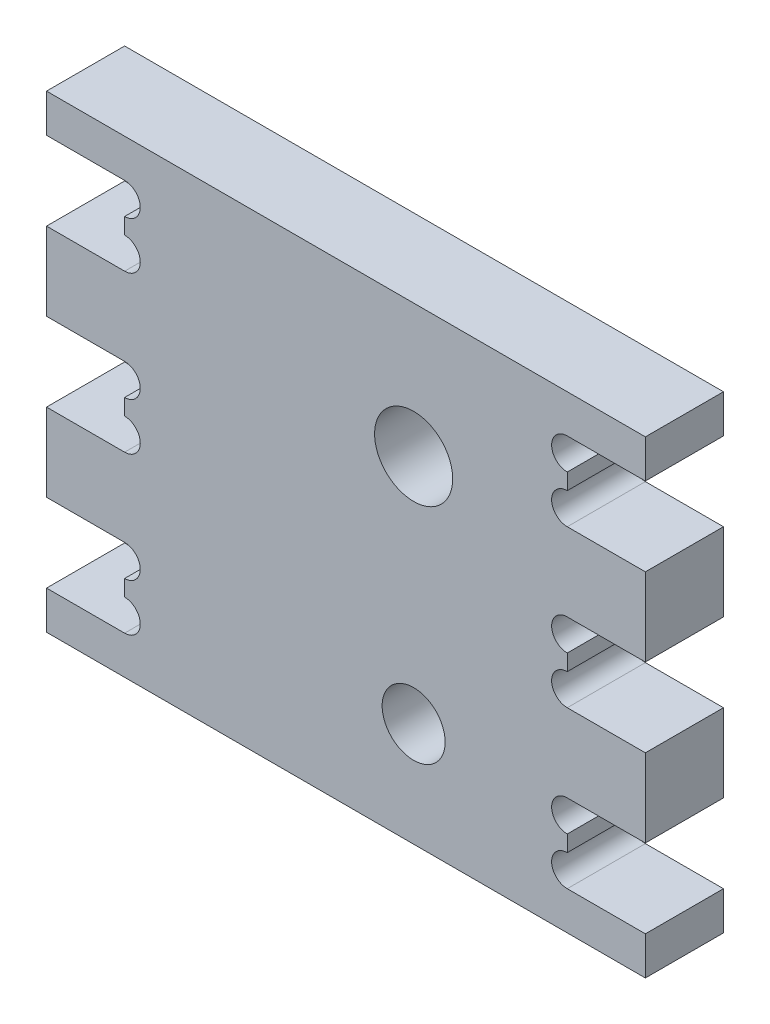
ISO-10303-21;
HEADER;
FILE_DESCRIPTION(('STEP AP214'),'2;1');
FILE_NAME('part.step','',(''),(''),'','','');
FILE_SCHEMA(('AUTOMOTIVE_DESIGN { 1 0 10303 214 1 1 1 1 }'));
ENDSEC;
DATA;
#1=APPLICATION_CONTEXT('core data for automotive mechanical design processes');
#2=APPLICATION_PROTOCOL_DEFINITION('international standard','automotive_design',2000,#1);
#3=PRODUCT_CONTEXT('',#1,'mechanical');
#4=PRODUCT('Part','Part','',(#3));
#5=PRODUCT_RELATED_PRODUCT_CATEGORY('part','',(#4));
#6=PRODUCT_DEFINITION_FORMATION('','',#4);
#7=PRODUCT_DEFINITION_CONTEXT('part definition',#1,'design');
#8=PRODUCT_DEFINITION('design','',#6,#7);
#9=PRODUCT_DEFINITION_SHAPE('','',#8);
#10=(LENGTH_UNIT() NAMED_UNIT(*) SI_UNIT(.MILLI.,.METRE.));
#11=(NAMED_UNIT(*) PLANE_ANGLE_UNIT() SI_UNIT($,.RADIAN.));
#12=(NAMED_UNIT(*) SI_UNIT($,.STERADIAN.) SOLID_ANGLE_UNIT());
#13=UNCERTAINTY_MEASURE_WITH_UNIT(LENGTH_MEASURE(1.E-05),#10,'distance_accuracy_value','');
#14=(GEOMETRIC_REPRESENTATION_CONTEXT(3) GLOBAL_UNCERTAINTY_ASSIGNED_CONTEXT((#13)) GLOBAL_UNIT_ASSIGNED_CONTEXT((#10,
#11,#12)) REPRESENTATION_CONTEXT('',''));
#15=CARTESIAN_POINT('',(0.,0.,0.));
#16=DIRECTION('',(0.,0.,1.));
#17=DIRECTION('',(1.,0.,0.));
#18=AXIS2_PLACEMENT_3D('',#15,#16,#17);
#19=CARTESIAN_POINT('',(0.,7.34999999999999,15.));
#20=DIRECTION('',(1.,0.,0.));
#21=DIRECTION('',(0.,1.,0.));
#22=AXIS2_PLACEMENT_3D('',#19,#20,#21);
#23=PLANE('',#22);
#24=DIRECTION('',(0.,-1.,0.));
#25=VECTOR('',#24,1.);
#26=CARTESIAN_POINT('',(0.,7.34999999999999,0.));
#27=LINE('',#26,#25);
#28=CARTESIAN_POINT('',(0.,7.34999999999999,0.));
#29=VERTEX_POINT('',#28);
#30=CARTESIAN_POINT('',(0.,0.,0.));
#31=VERTEX_POINT('',#30);
#32=EDGE_CURVE('E322',#29,#31,#27,.T.);
#33=ORIENTED_EDGE('',*,*,#32,.T.);
#34=DIRECTION('',(0.,0.,-1.));
#35=VECTOR('',#34,1.);
#36=CARTESIAN_POINT('',(0.,0.,15.));
#37=LINE('',#36,#35);
#38=CARTESIAN_POINT('',(0.,0.,15.));
#39=VERTEX_POINT('',#38);
#40=EDGE_CURVE('E11',#39,#31,#37,.T.);
#41=ORIENTED_EDGE('',*,*,#40,.F.);
#42=DIRECTION('',(0.,-1.,0.));
#43=VECTOR('',#42,1.);
#44=CARTESIAN_POINT('',(0.,7.34999999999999,15.));
#45=LINE('',#44,#43);
#46=CARTESIAN_POINT('',(0.,7.34999999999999,15.));
#47=VERTEX_POINT('',#46);
#48=EDGE_CURVE('E401',#47,#39,#45,.T.);
#49=ORIENTED_EDGE('',*,*,#48,.F.);
#50=DIRECTION('',(0.,0.,-1.));
#51=VECTOR('',#50,1.);
#52=CARTESIAN_POINT('',(0.,7.34999999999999,15.));
#53=LINE('',#52,#51);
#54=EDGE_CURVE('E318',#47,#29,#53,.T.);
#55=ORIENTED_EDGE('',*,*,#54,.T.);
#56=EDGE_LOOP('',(#33,#41,#49,#55));
#57=FACE_BOUND('',#56,.T.);
#58=ADVANCED_FACE('F34',(#57),#23,.F.);
#59=CARTESIAN_POINT('',(0.,0.,15.));
#60=DIRECTION('',(0.,1.,0.));
#61=DIRECTION('',(0.,0.,1.));
#62=AXIS2_PLACEMENT_3D('',#59,#60,#61);
#63=PLANE('',#62);
#64=DIRECTION('',(1.,0.,0.));
#65=VECTOR('',#64,1.);
#66=CARTESIAN_POINT('',(0.,0.,0.));
#67=LINE('',#66,#65);
#68=CARTESIAN_POINT('',(115.,0.,0.));
#69=VERTEX_POINT('',#68);
#70=EDGE_CURVE('E325',#31,#69,#67,.T.);
#71=ORIENTED_EDGE('',*,*,#70,.T.);
#72=DIRECTION('',(0.,0.,-1.));
#73=VECTOR('',#72,1.);
#74=CARTESIAN_POINT('',(115.,0.,15.));
#75=LINE('',#74,#73);
#76=CARTESIAN_POINT('',(115.,0.,15.));
#77=VERTEX_POINT('',#76);
#78=EDGE_CURVE('E42',#77,#69,#75,.T.);
#79=ORIENTED_EDGE('',*,*,#78,.F.);
#80=DIRECTION('',(1.,0.,0.));
#81=VECTOR('',#80,1.);
#82=CARTESIAN_POINT('',(0.,0.,15.));
#83=LINE('',#82,#81);
#84=EDGE_CURVE('E189',#39,#77,#83,.T.);
#85=ORIENTED_EDGE('',*,*,#84,.F.);
#86=ORIENTED_EDGE('',*,*,#40,.T.);
#87=EDGE_LOOP('',(#71,#79,#85,#86));
#88=FACE_BOUND('',#87,.T.);
#89=ADVANCED_FACE('F620',(#88),#63,.F.);
#90=CARTESIAN_POINT('',(115.,7.35,15.));
#91=DIRECTION('',(-1.,0.,0.));
#92=DIRECTION('',(0.,0.,1.));
#93=AXIS2_PLACEMENT_3D('',#90,#91,#92);
#94=PLANE('',#93);
#95=DIRECTION('',(0.,1.,0.));
#96=VECTOR('',#95,1.);
#97=CARTESIAN_POINT('',(115.,7.35,0.));
#98=LINE('',#97,#96);
#99=CARTESIAN_POINT('',(115.,7.35,0.));
#100=VERTEX_POINT('',#99);
#101=EDGE_CURVE('E328',#69,#100,#98,.T.);
#102=ORIENTED_EDGE('',*,*,#101,.T.);
#103=DIRECTION('',(0.,0.,-1.));
#104=VECTOR('',#103,1.);
#105=CARTESIAN_POINT('',(115.,7.35,15.));
#106=LINE('',#105,#104);
#107=CARTESIAN_POINT('',(115.,7.35,15.));
#108=VERTEX_POINT('',#107);
#109=EDGE_CURVE('E504',#108,#100,#106,.T.);
#110=ORIENTED_EDGE('',*,*,#109,.F.);
#111=DIRECTION('',(0.,1.,0.));
#112=VECTOR('',#111,1.);
#113=CARTESIAN_POINT('',(115.,7.35,15.));
#114=LINE('',#113,#112);
#115=EDGE_CURVE('E512',#77,#108,#114,.T.);
#116=ORIENTED_EDGE('',*,*,#115,.F.);
#117=ORIENTED_EDGE('',*,*,#78,.T.);
#118=EDGE_LOOP('',(#102,#110,#116,#117));
#119=FACE_BOUND('',#118,.T.);
#120=ADVANCED_FACE('F510',(#119),#94,.F.);
#121=CARTESIAN_POINT('',(100.,7.35,15.));
#122=DIRECTION('',(0.,-1.,0.));
#123=DIRECTION('',(0.,0.,-1.));
#124=AXIS2_PLACEMENT_3D('',#121,#122,#123);
#125=PLANE('',#124);
#126=DIRECTION('',(-1.,0.,0.));
#127=VECTOR('',#126,1.);
#128=CARTESIAN_POINT('',(100.,7.35,0.));
#129=LINE('',#128,#127);
#130=CARTESIAN_POINT('',(100.,7.35,0.));
#131=VERTEX_POINT('',#130);
#132=EDGE_CURVE('E330',#100,#131,#129,.T.);
#133=ORIENTED_EDGE('',*,*,#132,.T.);
#134=DIRECTION('',(0.,0.,-1.));
#135=VECTOR('',#134,1.);
#136=CARTESIAN_POINT('',(100.,7.35,15.));
#137=LINE('',#136,#135);
#138=CARTESIAN_POINT('',(100.,7.35,15.));
#139=VERTEX_POINT('',#138);
#140=EDGE_CURVE('E501',#139,#131,#137,.T.);
#141=ORIENTED_EDGE('',*,*,#140,.F.);
#142=DIRECTION('',(-1.,0.,0.));
#143=VECTOR('',#142,1.);
#144=CARTESIAN_POINT('',(100.,7.35,15.));
#145=LINE('',#144,#143);
#146=EDGE_CURVE('E530',#108,#139,#145,.T.);
#147=ORIENTED_EDGE('',*,*,#146,.F.);
#148=ORIENTED_EDGE('',*,*,#109,.T.);
#149=EDGE_LOOP('',(#133,#141,#147,#148));
#150=FACE_BOUND('',#149,.T.);
#151=ADVANCED_FACE('F521',(#150),#125,.F.);
#152=CARTESIAN_POINT('',(100.,10.35,15.));
#153=DIRECTION('',(0.,0.,-1.));
#154=DIRECTION('',(-1.,0.,0.));
#155=AXIS2_PLACEMENT_3D('',#152,#153,#154);
#156=CYLINDRICAL_SURFACE('',#155,3.);
#157=CARTESIAN_POINT('',(100.,10.35,0.));
#158=DIRECTION('',(0.,0.,-1.));
#159=DIRECTION('',(-1.,0.,0.));
#160=AXIS2_PLACEMENT_3D('',#157,#158,#159);
#161=CIRCLE('',#160,3.);
#162=CARTESIAN_POINT('',(100.,13.35,0.));
#163=VERTEX_POINT('',#162);
#164=EDGE_CURVE('E332',#131,#163,#161,.T.);
#165=ORIENTED_EDGE('',*,*,#164,.T.);
#166=DIRECTION('',(0.,0.,-1.));
#167=VECTOR('',#166,1.);
#168=CARTESIAN_POINT('',(100.,13.35,15.));
#169=LINE('',#168,#167);
#170=CARTESIAN_POINT('',(100.,13.35,15.));
#171=VERTEX_POINT('',#170);
#172=EDGE_CURVE('E498',#171,#163,#169,.T.);
#173=ORIENTED_EDGE('',*,*,#172,.F.);
#174=CARTESIAN_POINT('',(100.,10.35,15.));
#175=DIRECTION('',(0.,0.,-1.));
#176=DIRECTION('',(-1.,0.,0.));
#177=AXIS2_PLACEMENT_3D('',#174,#175,#176);
#178=CIRCLE('',#177,3.);
#179=EDGE_CURVE('E527',#139,#171,#178,.T.);
#180=ORIENTED_EDGE('',*,*,#179,.F.);
#181=ORIENTED_EDGE('',*,*,#140,.T.);
#182=EDGE_LOOP('',(#165,#173,#180,#181));
#183=FACE_BOUND('',#182,.T.);
#184=ADVANCED_FACE('F525',(#183),#156,.F.);
#185=CARTESIAN_POINT('',(100.,16.45,15.));
#186=DIRECTION('',(-1.,0.,0.));
#187=DIRECTION('',(0.,-1.,0.));
#188=AXIS2_PLACEMENT_3D('',#185,#186,#187);
#189=PLANE('',#188);
#190=DIRECTION('',(0.,1.,0.));
#191=VECTOR('',#190,1.);
#192=CARTESIAN_POINT('',(100.,16.45,0.));
#193=LINE('',#192,#191);
#194=CARTESIAN_POINT('',(100.,16.45,0.));
#195=VERTEX_POINT('',#194);
#196=EDGE_CURVE('E334',#163,#195,#193,.T.);
#197=ORIENTED_EDGE('',*,*,#196,.T.);
#198=DIRECTION('',(0.,0.,-1.));
#199=VECTOR('',#198,1.);
#200=CARTESIAN_POINT('',(100.,16.45,15.));
#201=LINE('',#200,#199);
#202=CARTESIAN_POINT('',(100.,16.45,15.));
#203=VERTEX_POINT('',#202);
#204=EDGE_CURVE('E495',#203,#195,#201,.T.);
#205=ORIENTED_EDGE('',*,*,#204,.F.);
#206=DIRECTION('',(0.,1.,0.));
#207=VECTOR('',#206,1.);
#208=CARTESIAN_POINT('',(100.,16.45,15.));
#209=LINE('',#208,#207);
#210=EDGE_CURVE('E529',#171,#203,#209,.T.);
#211=ORIENTED_EDGE('',*,*,#210,.F.);
#212=ORIENTED_EDGE('',*,*,#172,.T.);
#213=EDGE_LOOP('',(#197,#205,#211,#212));
#214=FACE_BOUND('',#213,.T.);
#215=ADVANCED_FACE('F633',(#214),#189,.F.);
#216=CARTESIAN_POINT('',(100.,19.45,15.));
#217=DIRECTION('',(0.,0.,-1.));
#218=DIRECTION('',(-1.,0.,0.));
#219=AXIS2_PLACEMENT_3D('',#216,#217,#218);
#220=CYLINDRICAL_SURFACE('',#219,3.);
#221=CARTESIAN_POINT('',(100.,19.45,0.));
#222=DIRECTION('',(0.,0.,-1.));
#223=DIRECTION('',(-1.,0.,0.));
#224=AXIS2_PLACEMENT_3D('',#221,#222,#223);
#225=CIRCLE('',#224,3.);
#226=CARTESIAN_POINT('',(100.,22.45,0.));
#227=VERTEX_POINT('',#226);
#228=EDGE_CURVE('E336',#195,#227,#225,.T.);
#229=ORIENTED_EDGE('',*,*,#228,.T.);
#230=DIRECTION('',(0.,0.,-1.));
#231=VECTOR('',#230,1.);
#232=CARTESIAN_POINT('',(100.,22.45,15.));
#233=LINE('',#232,#231);
#234=CARTESIAN_POINT('',(100.,22.45,15.));
#235=VERTEX_POINT('',#234);
#236=EDGE_CURVE('E492',#235,#227,#233,.T.);
#237=ORIENTED_EDGE('',*,*,#236,.F.);
#238=CARTESIAN_POINT('',(100.,19.45,15.));
#239=DIRECTION('',(0.,0.,-1.));
#240=DIRECTION('',(-1.,0.,0.));
#241=AXIS2_PLACEMENT_3D('',#238,#239,#240);
#242=CIRCLE('',#241,3.);
#243=EDGE_CURVE('E532',#203,#235,#242,.T.);
#244=ORIENTED_EDGE('',*,*,#243,.F.);
#245=ORIENTED_EDGE('',*,*,#204,.T.);
#246=EDGE_LOOP('',(#229,#237,#244,#245));
#247=FACE_BOUND('',#246,.T.);
#248=ADVANCED_FACE('F636',(#247),#220,.F.);
#249=CARTESIAN_POINT('',(115.,22.45,15.));
#250=DIRECTION('',(0.,1.,0.));
#251=DIRECTION('',(-1.,0.,0.));
#252=AXIS2_PLACEMENT_3D('',#249,#250,#251);
#253=PLANE('',#252);
#254=DIRECTION('',(1.,0.,0.));
#255=VECTOR('',#254,1.);
#256=CARTESIAN_POINT('',(115.,22.45,0.));
#257=LINE('',#256,#255);
#258=CARTESIAN_POINT('',(115.,22.45,0.));
#259=VERTEX_POINT('',#258);
#260=EDGE_CURVE('E338',#227,#259,#257,.T.);
#261=ORIENTED_EDGE('',*,*,#260,.T.);
#262=DIRECTION('',(0.,0.,-1.));
#263=VECTOR('',#262,1.);
#264=CARTESIAN_POINT('',(115.,22.45,15.));
#265=LINE('',#264,#263);
#266=CARTESIAN_POINT('',(115.,22.45,15.));
#267=VERTEX_POINT('',#266);
#268=EDGE_CURVE('E489',#267,#259,#265,.T.);
#269=ORIENTED_EDGE('',*,*,#268,.F.);
#270=DIRECTION('',(1.,0.,0.));
#271=VECTOR('',#270,1.);
#272=CARTESIAN_POINT('',(115.,22.45,15.));
#273=LINE('',#272,#271);
#274=EDGE_CURVE('E538',#235,#267,#273,.T.);
#275=ORIENTED_EDGE('',*,*,#274,.F.);
#276=ORIENTED_EDGE('',*,*,#236,.T.);
#277=EDGE_LOOP('',(#261,#269,#275,#276));
#278=FACE_BOUND('',#277,.T.);
#279=ADVANCED_FACE('F640',(#278),#253,.F.);
#280=CARTESIAN_POINT('',(115.,37.45,15.));
#281=DIRECTION('',(-1.,0.,0.));
#282=DIRECTION('',(0.,0.,1.));
#283=AXIS2_PLACEMENT_3D('',#280,#281,#282);
#284=PLANE('',#283);
#285=DIRECTION('',(0.,1.,0.));
#286=VECTOR('',#285,1.);
#287=CARTESIAN_POINT('',(115.,37.45,0.));
#288=LINE('',#287,#286);
#289=CARTESIAN_POINT('',(115.,37.45,0.));
#290=VERTEX_POINT('',#289);
#291=EDGE_CURVE('E340',#259,#290,#288,.T.);
#292=ORIENTED_EDGE('',*,*,#291,.T.);
#293=DIRECTION('',(0.,0.,-1.));
#294=VECTOR('',#293,1.);
#295=CARTESIAN_POINT('',(115.,37.45,15.));
#296=LINE('',#295,#294);
#297=CARTESIAN_POINT('',(115.,37.45,15.));
#298=VERTEX_POINT('',#297);
#299=EDGE_CURVE('E486',#298,#290,#296,.T.);
#300=ORIENTED_EDGE('',*,*,#299,.F.);
#301=DIRECTION('',(0.,1.,0.));
#302=VECTOR('',#301,1.);
#303=CARTESIAN_POINT('',(115.,37.45,15.));
#304=LINE('',#303,#302);
#305=EDGE_CURVE('E540',#267,#298,#304,.T.);
#306=ORIENTED_EDGE('',*,*,#305,.F.);
#307=ORIENTED_EDGE('',*,*,#268,.T.);
#308=EDGE_LOOP('',(#292,#300,#306,#307));
#309=FACE_BOUND('',#308,.T.);
#310=ADVANCED_FACE('F644',(#309),#284,.F.);
#311=CARTESIAN_POINT('',(100.,37.45,15.));
#312=DIRECTION('',(0.,-1.,0.));
#313=DIRECTION('',(0.,0.,-1.));
#314=AXIS2_PLACEMENT_3D('',#311,#312,#313);
#315=PLANE('',#314);
#316=DIRECTION('',(-1.,0.,0.));
#317=VECTOR('',#316,1.);
#318=CARTESIAN_POINT('',(100.,37.45,0.));
#319=LINE('',#318,#317);
#320=CARTESIAN_POINT('',(100.,37.45,0.));
#321=VERTEX_POINT('',#320);
#322=EDGE_CURVE('E342',#290,#321,#319,.T.);
#323=ORIENTED_EDGE('',*,*,#322,.T.);
#324=DIRECTION('',(0.,0.,-1.));
#325=VECTOR('',#324,1.);
#326=CARTESIAN_POINT('',(100.,37.45,15.));
#327=LINE('',#326,#325);
#328=CARTESIAN_POINT('',(100.,37.45,15.));
#329=VERTEX_POINT('',#328);
#330=EDGE_CURVE('E483',#329,#321,#327,.T.);
#331=ORIENTED_EDGE('',*,*,#330,.F.);
#332=DIRECTION('',(-1.,0.,0.));
#333=VECTOR('',#332,1.);
#334=CARTESIAN_POINT('',(100.,37.45,15.));
#335=LINE('',#334,#333);
#336=EDGE_CURVE('E542',#298,#329,#335,.T.);
#337=ORIENTED_EDGE('',*,*,#336,.F.);
#338=ORIENTED_EDGE('',*,*,#299,.T.);
#339=EDGE_LOOP('',(#323,#331,#337,#338));
#340=FACE_BOUND('',#339,.T.);
#341=ADVANCED_FACE('F648',(#340),#315,.F.);
#342=CARTESIAN_POINT('',(100.,40.45,15.));
#343=DIRECTION('',(0.,0.,-1.));
#344=DIRECTION('',(-1.,0.,0.));
#345=AXIS2_PLACEMENT_3D('',#342,#343,#344);
#346=CYLINDRICAL_SURFACE('',#345,3.);
#347=CARTESIAN_POINT('',(100.,40.45,0.));
#348=DIRECTION('',(0.,0.,-1.));
#349=DIRECTION('',(-1.,0.,0.));
#350=AXIS2_PLACEMENT_3D('',#347,#348,#349);
#351=CIRCLE('',#350,3.);
#352=CARTESIAN_POINT('',(100.,43.45,0.));
#353=VERTEX_POINT('',#352);
#354=EDGE_CURVE('E344',#321,#353,#351,.T.);
#355=ORIENTED_EDGE('',*,*,#354,.T.);
#356=DIRECTION('',(0.,0.,-1.));
#357=VECTOR('',#356,1.);
#358=CARTESIAN_POINT('',(100.,43.45,15.));
#359=LINE('',#358,#357);
#360=CARTESIAN_POINT('',(100.,43.45,15.));
#361=VERTEX_POINT('',#360);
#362=EDGE_CURVE('E480',#361,#353,#359,.T.);
#363=ORIENTED_EDGE('',*,*,#362,.F.);
#364=CARTESIAN_POINT('',(100.,40.45,15.));
#365=DIRECTION('',(0.,0.,-1.));
#366=DIRECTION('',(-1.,0.,0.));
#367=AXIS2_PLACEMENT_3D('',#364,#365,#366);
#368=CIRCLE('',#367,3.);
#369=EDGE_CURVE('E544',#329,#361,#368,.T.);
#370=ORIENTED_EDGE('',*,*,#369,.F.);
#371=ORIENTED_EDGE('',*,*,#330,.T.);
#372=EDGE_LOOP('',(#355,#363,#370,#371));
#373=FACE_BOUND('',#372,.T.);
#374=ADVANCED_FACE('F652',(#373),#346,.F.);
#375=CARTESIAN_POINT('',(100.,46.55,15.));
#376=DIRECTION('',(-1.,0.,0.));
#377=DIRECTION('',(0.,-1.,0.));
#378=AXIS2_PLACEMENT_3D('',#375,#376,#377);
#379=PLANE('',#378);
#380=DIRECTION('',(0.,1.,0.));
#381=VECTOR('',#380,1.);
#382=CARTESIAN_POINT('',(100.,46.55,0.));
#383=LINE('',#382,#381);
#384=CARTESIAN_POINT('',(100.,46.55,0.));
#385=VERTEX_POINT('',#384);
#386=EDGE_CURVE('E346',#353,#385,#383,.T.);
#387=ORIENTED_EDGE('',*,*,#386,.T.);
#388=DIRECTION('',(0.,0.,-1.));
#389=VECTOR('',#388,1.);
#390=CARTESIAN_POINT('',(100.,46.55,15.));
#391=LINE('',#390,#389);
#392=CARTESIAN_POINT('',(100.,46.55,15.));
#393=VERTEX_POINT('',#392);
#394=EDGE_CURVE('E477',#393,#385,#391,.T.);
#395=ORIENTED_EDGE('',*,*,#394,.F.);
#396=DIRECTION('',(0.,1.,0.));
#397=VECTOR('',#396,1.);
#398=CARTESIAN_POINT('',(100.,46.55,15.));
#399=LINE('',#398,#397);
#400=EDGE_CURVE('E546',#361,#393,#399,.T.);
#401=ORIENTED_EDGE('',*,*,#400,.F.);
#402=ORIENTED_EDGE('',*,*,#362,.T.);
#403=EDGE_LOOP('',(#387,#395,#401,#402));
#404=FACE_BOUND('',#403,.T.);
#405=ADVANCED_FACE('F656',(#404),#379,.F.);
#406=CARTESIAN_POINT('',(100.,49.55,15.));
#407=DIRECTION('',(0.,0.,-1.));
#408=DIRECTION('',(-1.,0.,0.));
#409=AXIS2_PLACEMENT_3D('',#406,#407,#408);
#410=CYLINDRICAL_SURFACE('',#409,3.);
#411=CARTESIAN_POINT('',(100.,49.55,0.));
#412=DIRECTION('',(0.,0.,-1.));
#413=DIRECTION('',(-1.,0.,0.));
#414=AXIS2_PLACEMENT_3D('',#411,#412,#413);
#415=CIRCLE('',#414,3.);
#416=CARTESIAN_POINT('',(100.,52.55,0.));
#417=VERTEX_POINT('',#416);
#418=EDGE_CURVE('E348',#385,#417,#415,.T.);
#419=ORIENTED_EDGE('',*,*,#418,.T.);
#420=DIRECTION('',(0.,0.,-1.));
#421=VECTOR('',#420,1.);
#422=CARTESIAN_POINT('',(100.,52.55,15.));
#423=LINE('',#422,#421);
#424=CARTESIAN_POINT('',(100.,52.55,15.));
#425=VERTEX_POINT('',#424);
#426=EDGE_CURVE('E474',#425,#417,#423,.T.);
#427=ORIENTED_EDGE('',*,*,#426,.F.);
#428=CARTESIAN_POINT('',(100.,49.55,15.));
#429=DIRECTION('',(0.,0.,-1.));
#430=DIRECTION('',(-1.,0.,0.));
#431=AXIS2_PLACEMENT_3D('',#428,#429,#430);
#432=CIRCLE('',#431,3.);
#433=EDGE_CURVE('E548',#393,#425,#432,.T.);
#434=ORIENTED_EDGE('',*,*,#433,.F.);
#435=ORIENTED_EDGE('',*,*,#394,.T.);
#436=EDGE_LOOP('',(#419,#427,#434,#435));
#437=FACE_BOUND('',#436,.T.);
#438=ADVANCED_FACE('F660',(#437),#410,.F.);
#439=CARTESIAN_POINT('',(115.,52.55,15.));
#440=DIRECTION('',(0.,1.,0.));
#441=DIRECTION('',(0.,0.,1.));
#442=AXIS2_PLACEMENT_3D('',#439,#440,#441);
#443=PLANE('',#442);
#444=DIRECTION('',(1.,0.,0.));
#445=VECTOR('',#444,1.);
#446=CARTESIAN_POINT('',(115.,52.55,0.));
#447=LINE('',#446,#445);
#448=CARTESIAN_POINT('',(115.,52.55,0.));
#449=VERTEX_POINT('',#448);
#450=EDGE_CURVE('E350',#417,#449,#447,.T.);
#451=ORIENTED_EDGE('',*,*,#450,.T.);
#452=DIRECTION('',(0.,0.,-1.));
#453=VECTOR('',#452,1.);
#454=CARTESIAN_POINT('',(115.,52.55,15.));
#455=LINE('',#454,#453);
#456=CARTESIAN_POINT('',(115.,52.55,15.));
#457=VERTEX_POINT('',#456);
#458=EDGE_CURVE('E471',#457,#449,#455,.T.);
#459=ORIENTED_EDGE('',*,*,#458,.F.);
#460=DIRECTION('',(1.,0.,0.));
#461=VECTOR('',#460,1.);
#462=CARTESIAN_POINT('',(115.,52.55,15.));
#463=LINE('',#462,#461);
#464=EDGE_CURVE('E550',#425,#457,#463,.T.);
#465=ORIENTED_EDGE('',*,*,#464,.F.);
#466=ORIENTED_EDGE('',*,*,#426,.T.);
#467=EDGE_LOOP('',(#451,#459,#465,#466));
#468=FACE_BOUND('',#467,.T.);
#469=ADVANCED_FACE('F664',(#468),#443,.F.);
#470=CARTESIAN_POINT('',(115.,67.55,15.));
#471=DIRECTION('',(-1.,0.,0.));
#472=DIRECTION('',(0.,0.,1.));
#473=AXIS2_PLACEMENT_3D('',#470,#471,#472);
#474=PLANE('',#473);
#475=DIRECTION('',(0.,1.,0.));
#476=VECTOR('',#475,1.);
#477=CARTESIAN_POINT('',(115.,67.55,0.));
#478=LINE('',#477,#476);
#479=CARTESIAN_POINT('',(115.,67.55,0.));
#480=VERTEX_POINT('',#479);
#481=EDGE_CURVE('E352',#449,#480,#478,.T.);
#482=ORIENTED_EDGE('',*,*,#481,.T.);
#483=DIRECTION('',(0.,0.,-1.));
#484=VECTOR('',#483,1.);
#485=CARTESIAN_POINT('',(115.,67.55,15.));
#486=LINE('',#485,#484);
#487=CARTESIAN_POINT('',(115.,67.55,15.));
#488=VERTEX_POINT('',#487);
#489=EDGE_CURVE('E468',#488,#480,#486,.T.);
#490=ORIENTED_EDGE('',*,*,#489,.F.);
#491=DIRECTION('',(0.,1.,0.));
#492=VECTOR('',#491,1.);
#493=CARTESIAN_POINT('',(115.,67.55,15.));
#494=LINE('',#493,#492);
#495=EDGE_CURVE('E552',#457,#488,#494,.T.);
#496=ORIENTED_EDGE('',*,*,#495,.F.);
#497=ORIENTED_EDGE('',*,*,#458,.T.);
#498=EDGE_LOOP('',(#482,#490,#496,#497));
#499=FACE_BOUND('',#498,.T.);
#500=ADVANCED_FACE('F668',(#499),#474,.F.);
#501=CARTESIAN_POINT('',(100.,67.55,15.));
#502=DIRECTION('',(0.,-1.,0.));
#503=DIRECTION('',(0.,0.,-1.));
#504=AXIS2_PLACEMENT_3D('',#501,#502,#503);
#505=PLANE('',#504);
#506=DIRECTION('',(-1.,0.,0.));
#507=VECTOR('',#506,1.);
#508=CARTESIAN_POINT('',(100.,67.55,0.));
#509=LINE('',#508,#507);
#510=CARTESIAN_POINT('',(100.,67.55,0.));
#511=VERTEX_POINT('',#510);
#512=EDGE_CURVE('E354',#480,#511,#509,.T.);
#513=ORIENTED_EDGE('',*,*,#512,.T.);
#514=DIRECTION('',(0.,0.,-1.));
#515=VECTOR('',#514,1.);
#516=CARTESIAN_POINT('',(100.,67.55,15.));
#517=LINE('',#516,#515);
#518=CARTESIAN_POINT('',(100.,67.55,15.));
#519=VERTEX_POINT('',#518);
#520=EDGE_CURVE('E465',#519,#511,#517,.T.);
#521=ORIENTED_EDGE('',*,*,#520,.F.);
#522=DIRECTION('',(-1.,0.,0.));
#523=VECTOR('',#522,1.);
#524=CARTESIAN_POINT('',(100.,67.55,15.));
#525=LINE('',#524,#523);
#526=EDGE_CURVE('E554',#488,#519,#525,.T.);
#527=ORIENTED_EDGE('',*,*,#526,.F.);
#528=ORIENTED_EDGE('',*,*,#489,.T.);
#529=EDGE_LOOP('',(#513,#521,#527,#528));
#530=FACE_BOUND('',#529,.T.);
#531=ADVANCED_FACE('F672',(#530),#505,.F.);
#532=CARTESIAN_POINT('',(100.,70.55,15.));
#533=DIRECTION('',(0.,0.,-1.));
#534=DIRECTION('',(-1.,0.,0.));
#535=AXIS2_PLACEMENT_3D('',#532,#533,#534);
#536=CYLINDRICAL_SURFACE('',#535,3.);
#537=CARTESIAN_POINT('',(100.,70.55,0.));
#538=DIRECTION('',(0.,0.,-1.));
#539=DIRECTION('',(-1.,0.,0.));
#540=AXIS2_PLACEMENT_3D('',#537,#538,#539);
#541=CIRCLE('',#540,3.);
#542=CARTESIAN_POINT('',(100.,73.55,0.));
#543=VERTEX_POINT('',#542);
#544=EDGE_CURVE('E356',#511,#543,#541,.T.);
#545=ORIENTED_EDGE('',*,*,#544,.T.);
#546=DIRECTION('',(0.,0.,-1.));
#547=VECTOR('',#546,1.);
#548=CARTESIAN_POINT('',(100.,73.55,15.));
#549=LINE('',#548,#547);
#550=CARTESIAN_POINT('',(100.,73.55,15.));
#551=VERTEX_POINT('',#550);
#552=EDGE_CURVE('E462',#551,#543,#549,.T.);
#553=ORIENTED_EDGE('',*,*,#552,.F.);
#554=CARTESIAN_POINT('',(100.,70.55,15.));
#555=DIRECTION('',(0.,0.,-1.));
#556=DIRECTION('',(-1.,0.,0.));
#557=AXIS2_PLACEMENT_3D('',#554,#555,#556);
#558=CIRCLE('',#557,3.);
#559=EDGE_CURVE('E556',#519,#551,#558,.T.);
#560=ORIENTED_EDGE('',*,*,#559,.F.);
#561=ORIENTED_EDGE('',*,*,#520,.T.);
#562=EDGE_LOOP('',(#545,#553,#560,#561));
#563=FACE_BOUND('',#562,.T.);
#564=ADVANCED_FACE('F676',(#563),#536,.F.);
#565=CARTESIAN_POINT('',(100.,76.65,15.));
#566=DIRECTION('',(-1.,0.,0.));
#567=DIRECTION('',(0.,0.,1.));
#568=AXIS2_PLACEMENT_3D('',#565,#566,#567);
#569=PLANE('',#568);
#570=DIRECTION('',(0.,1.,0.));
#571=VECTOR('',#570,1.);
#572=CARTESIAN_POINT('',(100.,76.65,0.));
#573=LINE('',#572,#571);
#574=CARTESIAN_POINT('',(100.,76.65,0.));
#575=VERTEX_POINT('',#574);
#576=EDGE_CURVE('E358',#543,#575,#573,.T.);
#577=ORIENTED_EDGE('',*,*,#576,.T.);
#578=DIRECTION('',(0.,0.,-1.));
#579=VECTOR('',#578,1.);
#580=CARTESIAN_POINT('',(100.,76.65,15.));
#581=LINE('',#580,#579);
#582=CARTESIAN_POINT('',(100.,76.65,15.));
#583=VERTEX_POINT('',#582);
#584=EDGE_CURVE('E459',#583,#575,#581,.T.);
#585=ORIENTED_EDGE('',*,*,#584,.F.);
#586=DIRECTION('',(0.,1.,0.));
#587=VECTOR('',#586,1.);
#588=CARTESIAN_POINT('',(100.,76.65,15.));
#589=LINE('',#588,#587);
#590=EDGE_CURVE('E558',#551,#583,#589,.T.);
#591=ORIENTED_EDGE('',*,*,#590,.F.);
#592=ORIENTED_EDGE('',*,*,#552,.T.);
#593=EDGE_LOOP('',(#577,#585,#591,#592));
#594=FACE_BOUND('',#593,.T.);
#595=ADVANCED_FACE('F680',(#594),#569,.F.);
#596=CARTESIAN_POINT('',(100.,79.65,15.));
#597=DIRECTION('',(0.,0.,-1.));
#598=DIRECTION('',(-1.,0.,0.));
#599=AXIS2_PLACEMENT_3D('',#596,#597,#598);
#600=CYLINDRICAL_SURFACE('',#599,3.);
#601=CARTESIAN_POINT('',(100.,79.65,0.));
#602=DIRECTION('',(0.,0.,-1.));
#603=DIRECTION('',(-1.,0.,0.));
#604=AXIS2_PLACEMENT_3D('',#601,#602,#603);
#605=CIRCLE('',#604,3.);
#606=CARTESIAN_POINT('',(100.,82.65,0.));
#607=VERTEX_POINT('',#606);
#608=EDGE_CURVE('E360',#575,#607,#605,.T.);
#609=ORIENTED_EDGE('',*,*,#608,.T.);
#610=DIRECTION('',(0.,0.,-1.));
#611=VECTOR('',#610,1.);
#612=CARTESIAN_POINT('',(100.,82.65,15.));
#613=LINE('',#612,#611);
#614=CARTESIAN_POINT('',(100.,82.65,15.));
#615=VERTEX_POINT('',#614);
#616=EDGE_CURVE('E456',#615,#607,#613,.T.);
#617=ORIENTED_EDGE('',*,*,#616,.F.);
#618=CARTESIAN_POINT('',(100.,79.65,15.));
#619=DIRECTION('',(0.,0.,-1.));
#620=DIRECTION('',(-1.,0.,0.));
#621=AXIS2_PLACEMENT_3D('',#618,#619,#620);
#622=CIRCLE('',#621,3.);
#623=EDGE_CURVE('E560',#583,#615,#622,.T.);
#624=ORIENTED_EDGE('',*,*,#623,.F.);
#625=ORIENTED_EDGE('',*,*,#584,.T.);
#626=EDGE_LOOP('',(#609,#617,#624,#625));
#627=FACE_BOUND('',#626,.T.);
#628=ADVANCED_FACE('F684',(#627),#600,.F.);
#629=CARTESIAN_POINT('',(115.,82.65,15.));
#630=DIRECTION('',(0.,1.,0.));
#631=DIRECTION('',(0.,0.,1.));
#632=AXIS2_PLACEMENT_3D('',#629,#630,#631);
#633=PLANE('',#632);
#634=DIRECTION('',(1.,0.,0.));
#635=VECTOR('',#634,1.);
#636=CARTESIAN_POINT('',(115.,82.65,0.));
#637=LINE('',#636,#635);
#638=CARTESIAN_POINT('',(115.,82.65,0.));
#639=VERTEX_POINT('',#638);
#640=EDGE_CURVE('E362',#607,#639,#637,.T.);
#641=ORIENTED_EDGE('',*,*,#640,.T.);
#642=DIRECTION('',(0.,0.,-1.));
#643=VECTOR('',#642,1.);
#644=CARTESIAN_POINT('',(115.,82.65,15.));
#645=LINE('',#644,#643);
#646=CARTESIAN_POINT('',(115.,82.65,15.));
#647=VERTEX_POINT('',#646);
#648=EDGE_CURVE('E453',#647,#639,#645,.T.);
#649=ORIENTED_EDGE('',*,*,#648,.F.);
#650=DIRECTION('',(1.,0.,0.));
#651=VECTOR('',#650,1.);
#652=CARTESIAN_POINT('',(115.,82.65,15.));
#653=LINE('',#652,#651);
#654=EDGE_CURVE('E562',#615,#647,#653,.T.);
#655=ORIENTED_EDGE('',*,*,#654,.F.);
#656=ORIENTED_EDGE('',*,*,#616,.T.);
#657=EDGE_LOOP('',(#641,#649,#655,#656));
#658=FACE_BOUND('',#657,.T.);
#659=ADVANCED_FACE('F688',(#658),#633,.F.);
#660=CARTESIAN_POINT('',(115.,90.,15.));
#661=DIRECTION('',(-1.,0.,0.));
#662=DIRECTION('',(0.,0.,1.));
#663=AXIS2_PLACEMENT_3D('',#660,#661,#662);
#664=PLANE('',#663);
#665=DIRECTION('',(0.,1.,0.));
#666=VECTOR('',#665,1.);
#667=CARTESIAN_POINT('',(115.,90.,0.));
#668=LINE('',#667,#666);
#669=CARTESIAN_POINT('',(115.,90.,0.));
#670=VERTEX_POINT('',#669);
#671=EDGE_CURVE('E364',#639,#670,#668,.T.);
#672=ORIENTED_EDGE('',*,*,#671,.T.);
#673=DIRECTION('',(0.,0.,-1.));
#674=VECTOR('',#673,1.);
#675=CARTESIAN_POINT('',(115.,90.,15.));
#676=LINE('',#675,#674);
#677=CARTESIAN_POINT('',(115.,90.,15.));
#678=VERTEX_POINT('',#677);
#679=EDGE_CURVE('E450',#678,#670,#676,.T.);
#680=ORIENTED_EDGE('',*,*,#679,.F.);
#681=DIRECTION('',(0.,1.,0.));
#682=VECTOR('',#681,1.);
#683=CARTESIAN_POINT('',(115.,90.,15.));
#684=LINE('',#683,#682);
#685=EDGE_CURVE('E564',#647,#678,#684,.T.);
#686=ORIENTED_EDGE('',*,*,#685,.F.);
#687=ORIENTED_EDGE('',*,*,#648,.T.);
#688=EDGE_LOOP('',(#672,#680,#686,#687));
#689=FACE_BOUND('',#688,.T.);
#690=ADVANCED_FACE('F692',(#689),#664,.F.);
#691=CARTESIAN_POINT('',(0.,90.,15.));
#692=DIRECTION('',(0.,-1.,0.));
#693=DIRECTION('',(0.,0.,-1.));
#694=AXIS2_PLACEMENT_3D('',#691,#692,#693);
#695=PLANE('',#694);
#696=DIRECTION('',(-1.,0.,0.));
#697=VECTOR('',#696,1.);
#698=CARTESIAN_POINT('',(0.,90.,0.));
#699=LINE('',#698,#697);
#700=CARTESIAN_POINT('',(0.,90.,0.));
#701=VERTEX_POINT('',#700);
#702=EDGE_CURVE('E366',#670,#701,#699,.T.);
#703=ORIENTED_EDGE('',*,*,#702,.T.);
#704=DIRECTION('',(0.,0.,-1.));
#705=VECTOR('',#704,1.);
#706=CARTESIAN_POINT('',(0.,90.,15.));
#707=LINE('',#706,#705);
#708=CARTESIAN_POINT('',(0.,90.,15.));
#709=VERTEX_POINT('',#708);
#710=EDGE_CURVE('E447',#709,#701,#707,.T.);
#711=ORIENTED_EDGE('',*,*,#710,.F.);
#712=DIRECTION('',(-1.,0.,0.));
#713=VECTOR('',#712,1.);
#714=CARTESIAN_POINT('',(0.,90.,15.));
#715=LINE('',#714,#713);
#716=EDGE_CURVE('E566',#678,#709,#715,.T.);
#717=ORIENTED_EDGE('',*,*,#716,.F.);
#718=ORIENTED_EDGE('',*,*,#679,.T.);
#719=EDGE_LOOP('',(#703,#711,#717,#718));
#720=FACE_BOUND('',#719,.T.);
#721=ADVANCED_FACE('F696',(#720),#695,.F.);
#722=CARTESIAN_POINT('',(0.,82.65,15.));
#723=DIRECTION('',(1.,0.,0.));
#724=DIRECTION('',(0.,1.,0.));
#725=AXIS2_PLACEMENT_3D('',#722,#723,#724);
#726=PLANE('',#725);
#727=DIRECTION('',(0.,-1.,0.));
#728=VECTOR('',#727,1.);
#729=CARTESIAN_POINT('',(0.,82.65,0.));
#730=LINE('',#729,#728);
#731=CARTESIAN_POINT('',(0.,82.65,0.));
#732=VERTEX_POINT('',#731);
#733=EDGE_CURVE('E368',#701,#732,#730,.T.);
#734=ORIENTED_EDGE('',*,*,#733,.T.);
#735=DIRECTION('',(0.,0.,-1.));
#736=VECTOR('',#735,1.);
#737=CARTESIAN_POINT('',(0.,82.65,15.));
#738=LINE('',#737,#736);
#739=CARTESIAN_POINT('',(0.,82.65,15.));
#740=VERTEX_POINT('',#739);
#741=EDGE_CURVE('E444',#740,#732,#738,.T.);
#742=ORIENTED_EDGE('',*,*,#741,.F.);
#743=DIRECTION('',(0.,-1.,0.));
#744=VECTOR('',#743,1.);
#745=CARTESIAN_POINT('',(0.,82.65,15.));
#746=LINE('',#745,#744);
#747=EDGE_CURVE('E568',#709,#740,#746,.T.);
#748=ORIENTED_EDGE('',*,*,#747,.F.);
#749=ORIENTED_EDGE('',*,*,#710,.T.);
#750=EDGE_LOOP('',(#734,#742,#748,#749));
#751=FACE_BOUND('',#750,.T.);
#752=ADVANCED_FACE('F700',(#751),#726,.F.);
#753=CARTESIAN_POINT('',(15.,82.65,15.));
#754=DIRECTION('',(0.,1.,0.));
#755=DIRECTION('',(-1.,0.,0.));
#756=AXIS2_PLACEMENT_3D('',#753,#754,#755);
#757=PLANE('',#756);
#758=DIRECTION('',(1.,0.,0.));
#759=VECTOR('',#758,1.);
#760=CARTESIAN_POINT('',(15.,82.65,0.));
#761=LINE('',#760,#759);
#762=CARTESIAN_POINT('',(15.,82.65,0.));
#763=VERTEX_POINT('',#762);
#764=EDGE_CURVE('E370',#732,#763,#761,.T.);
#765=ORIENTED_EDGE('',*,*,#764,.T.);
#766=DIRECTION('',(0.,0.,-1.));
#767=VECTOR('',#766,1.);
#768=CARTESIAN_POINT('',(15.,82.65,15.));
#769=LINE('',#768,#767);
#770=CARTESIAN_POINT('',(15.,82.65,15.));
#771=VERTEX_POINT('',#770);
#772=EDGE_CURVE('E441',#771,#763,#769,.T.);
#773=ORIENTED_EDGE('',*,*,#772,.F.);
#774=DIRECTION('',(1.,0.,0.));
#775=VECTOR('',#774,1.);
#776=CARTESIAN_POINT('',(15.,82.65,15.));
#777=LINE('',#776,#775);
#778=EDGE_CURVE('E570',#740,#771,#777,.T.);
#779=ORIENTED_EDGE('',*,*,#778,.F.);
#780=ORIENTED_EDGE('',*,*,#741,.T.);
#781=EDGE_LOOP('',(#765,#773,#779,#780));
#782=FACE_BOUND('',#781,.T.);
#783=ADVANCED_FACE('F704',(#782),#757,.F.);
#784=CARTESIAN_POINT('',(15.,79.65,15.));
#785=DIRECTION('',(0.,0.,-1.));
#786=DIRECTION('',(-1.,0.,0.));
#787=AXIS2_PLACEMENT_3D('',#784,#785,#786);
#788=CYLINDRICAL_SURFACE('',#787,3.);
#789=CARTESIAN_POINT('',(15.,79.65,0.));
#790=DIRECTION('',(0.,0.,-1.));
#791=DIRECTION('',(1.,0.,0.));
#792=AXIS2_PLACEMENT_3D('',#789,#790,#791);
#793=CIRCLE('',#792,3.);
#794=CARTESIAN_POINT('',(15.,76.65,0.));
#795=VERTEX_POINT('',#794);
#796=EDGE_CURVE('E372',#763,#795,#793,.T.);
#797=ORIENTED_EDGE('',*,*,#796,.T.);
#798=DIRECTION('',(0.,0.,-1.));
#799=VECTOR('',#798,1.);
#800=CARTESIAN_POINT('',(15.,76.65,15.));
#801=LINE('',#800,#799);
#802=CARTESIAN_POINT('',(15.,76.65,15.));
#803=VERTEX_POINT('',#802);
#804=EDGE_CURVE('E438',#803,#795,#801,.T.);
#805=ORIENTED_EDGE('',*,*,#804,.F.);
#806=CARTESIAN_POINT('',(15.,79.65,15.));
#807=DIRECTION('',(0.,0.,-1.));
#808=DIRECTION('',(1.,0.,0.));
#809=AXIS2_PLACEMENT_3D('',#806,#807,#808);
#810=CIRCLE('',#809,3.);
#811=EDGE_CURVE('E572',#771,#803,#810,.T.);
#812=ORIENTED_EDGE('',*,*,#811,.F.);
#813=ORIENTED_EDGE('',*,*,#772,.T.);
#814=EDGE_LOOP('',(#797,#805,#812,#813));
#815=FACE_BOUND('',#814,.T.);
#816=ADVANCED_FACE('F708',(#815),#788,.F.);
#817=CARTESIAN_POINT('',(15.,76.65,15.));
#818=DIRECTION('',(1.,0.,0.));
#819=DIRECTION('',(0.,1.,0.));
#820=AXIS2_PLACEMENT_3D('',#817,#818,#819);
#821=PLANE('',#820);
#822=DIRECTION('',(0.,-1.,0.));
#823=VECTOR('',#822,1.);
#824=CARTESIAN_POINT('',(15.,76.65,0.));
#825=LINE('',#824,#823);
#826=CARTESIAN_POINT('',(15.,73.55,0.));
#827=VERTEX_POINT('',#826);
#828=EDGE_CURVE('E374',#795,#827,#825,.T.);
#829=ORIENTED_EDGE('',*,*,#828,.T.);
#830=DIRECTION('',(0.,0.,-1.));
#831=VECTOR('',#830,1.);
#832=CARTESIAN_POINT('',(15.,73.55,15.));
#833=LINE('',#832,#831);
#834=CARTESIAN_POINT('',(15.,73.55,15.));
#835=VERTEX_POINT('',#834);
#836=EDGE_CURVE('E435',#835,#827,#833,.T.);
#837=ORIENTED_EDGE('',*,*,#836,.F.);
#838=DIRECTION('',(0.,-1.,0.));
#839=VECTOR('',#838,1.);
#840=CARTESIAN_POINT('',(15.,76.65,15.));
#841=LINE('',#840,#839);
#842=EDGE_CURVE('E574',#803,#835,#841,.T.);
#843=ORIENTED_EDGE('',*,*,#842,.F.);
#844=ORIENTED_EDGE('',*,*,#804,.T.);
#845=EDGE_LOOP('',(#829,#837,#843,#844));
#846=FACE_BOUND('',#845,.T.);
#847=ADVANCED_FACE('F712',(#846),#821,.F.);
#848=CARTESIAN_POINT('',(15.,70.55,15.));
#849=DIRECTION('',(0.,0.,-1.));
#850=DIRECTION('',(-1.,0.,0.));
#851=AXIS2_PLACEMENT_3D('',#848,#849,#850);
#852=CYLINDRICAL_SURFACE('',#851,3.);
#853=CARTESIAN_POINT('',(15.,70.55,0.));
#854=DIRECTION('',(0.,0.,-1.));
#855=DIRECTION('',(-1.,0.,0.));
#856=AXIS2_PLACEMENT_3D('',#853,#854,#855);
#857=CIRCLE('',#856,3.);
#858=CARTESIAN_POINT('',(15.,67.55,0.));
#859=VERTEX_POINT('',#858);
#860=EDGE_CURVE('E376',#827,#859,#857,.T.);
#861=ORIENTED_EDGE('',*,*,#860,.T.);
#862=DIRECTION('',(0.,0.,-1.));
#863=VECTOR('',#862,1.);
#864=CARTESIAN_POINT('',(15.,67.55,15.));
#865=LINE('',#864,#863);
#866=CARTESIAN_POINT('',(15.,67.55,15.));
#867=VERTEX_POINT('',#866);
#868=EDGE_CURVE('E432',#867,#859,#865,.T.);
#869=ORIENTED_EDGE('',*,*,#868,.F.);
#870=CARTESIAN_POINT('',(15.,70.55,15.));
#871=DIRECTION('',(0.,0.,-1.));
#872=DIRECTION('',(-1.,0.,0.));
#873=AXIS2_PLACEMENT_3D('',#870,#871,#872);
#874=CIRCLE('',#873,3.);
#875=EDGE_CURVE('E576',#835,#867,#874,.T.);
#876=ORIENTED_EDGE('',*,*,#875,.F.);
#877=ORIENTED_EDGE('',*,*,#836,.T.);
#878=EDGE_LOOP('',(#861,#869,#876,#877));
#879=FACE_BOUND('',#878,.T.);
#880=ADVANCED_FACE('F716',(#879),#852,.F.);
#881=CARTESIAN_POINT('',(15.,67.55,15.));
#882=DIRECTION('',(0.,-1.,0.));
#883=DIRECTION('',(1.,0.,0.));
#884=AXIS2_PLACEMENT_3D('',#881,#882,#883);
#885=PLANE('',#884);
#886=DIRECTION('',(-1.,0.,0.));
#887=VECTOR('',#886,1.);
#888=CARTESIAN_POINT('',(15.,67.55,0.));
#889=LINE('',#888,#887);
#890=CARTESIAN_POINT('',(0.,67.55,0.));
#891=VERTEX_POINT('',#890);
#892=EDGE_CURVE('E378',#859,#891,#889,.T.);
#893=ORIENTED_EDGE('',*,*,#892,.T.);
#894=DIRECTION('',(0.,0.,-1.));
#895=VECTOR('',#894,1.);
#896=CARTESIAN_POINT('',(0.,67.55,15.));
#897=LINE('',#896,#895);
#898=CARTESIAN_POINT('',(0.,67.55,15.));
#899=VERTEX_POINT('',#898);
#900=EDGE_CURVE('E429',#899,#891,#897,.T.);
#901=ORIENTED_EDGE('',*,*,#900,.F.);
#902=DIRECTION('',(-1.,0.,0.));
#903=VECTOR('',#902,1.);
#904=CARTESIAN_POINT('',(15.,67.55,15.));
#905=LINE('',#904,#903);
#906=EDGE_CURVE('E578',#867,#899,#905,.T.);
#907=ORIENTED_EDGE('',*,*,#906,.F.);
#908=ORIENTED_EDGE('',*,*,#868,.T.);
#909=EDGE_LOOP('',(#893,#901,#907,#908));
#910=FACE_BOUND('',#909,.T.);
#911=ADVANCED_FACE('F720',(#910),#885,.F.);
#912=CARTESIAN_POINT('',(0.,67.55,15.));
#913=DIRECTION('',(1.,0.,0.));
#914=DIRECTION('',(0.,1.,0.));
#915=AXIS2_PLACEMENT_3D('',#912,#913,#914);
#916=PLANE('',#915);
#917=DIRECTION('',(0.,-1.,0.));
#918=VECTOR('',#917,1.);
#919=CARTESIAN_POINT('',(0.,67.55,0.));
#920=LINE('',#919,#918);
#921=CARTESIAN_POINT('',(0.,52.55,0.));
#922=VERTEX_POINT('',#921);
#923=EDGE_CURVE('E380',#891,#922,#920,.T.);
#924=ORIENTED_EDGE('',*,*,#923,.T.);
#925=DIRECTION('',(0.,0.,-1.));
#926=VECTOR('',#925,1.);
#927=CARTESIAN_POINT('',(0.,52.55,15.));
#928=LINE('',#927,#926);
#929=CARTESIAN_POINT('',(0.,52.55,15.));
#930=VERTEX_POINT('',#929);
#931=EDGE_CURVE('E426',#930,#922,#928,.T.);
#932=ORIENTED_EDGE('',*,*,#931,.F.);
#933=DIRECTION('',(0.,-1.,0.));
#934=VECTOR('',#933,1.);
#935=CARTESIAN_POINT('',(0.,67.55,15.));
#936=LINE('',#935,#934);
#937=EDGE_CURVE('E580',#899,#930,#936,.T.);
#938=ORIENTED_EDGE('',*,*,#937,.F.);
#939=ORIENTED_EDGE('',*,*,#900,.T.);
#940=EDGE_LOOP('',(#924,#932,#938,#939));
#941=FACE_BOUND('',#940,.T.);
#942=ADVANCED_FACE('F724',(#941),#916,.F.);
#943=CARTESIAN_POINT('',(0.,52.55,15.));
#944=DIRECTION('',(0.,1.,0.));
#945=DIRECTION('',(-1.,0.,0.));
#946=AXIS2_PLACEMENT_3D('',#943,#944,#945);
#947=PLANE('',#946);
#948=DIRECTION('',(1.,0.,0.));
#949=VECTOR('',#948,1.);
#950=CARTESIAN_POINT('',(0.,52.55,0.));
#951=LINE('',#950,#949);
#952=CARTESIAN_POINT('',(15.,52.55,0.));
#953=VERTEX_POINT('',#952);
#954=EDGE_CURVE('E382',#922,#953,#951,.T.);
#955=ORIENTED_EDGE('',*,*,#954,.T.);
#956=DIRECTION('',(0.,0.,-1.));
#957=VECTOR('',#956,1.);
#958=CARTESIAN_POINT('',(15.,52.55,15.));
#959=LINE('',#958,#957);
#960=CARTESIAN_POINT('',(15.,52.55,15.));
#961=VERTEX_POINT('',#960);
#962=EDGE_CURVE('E423',#961,#953,#959,.T.);
#963=ORIENTED_EDGE('',*,*,#962,.F.);
#964=DIRECTION('',(1.,0.,0.));
#965=VECTOR('',#964,1.);
#966=CARTESIAN_POINT('',(0.,52.55,15.));
#967=LINE('',#966,#965);
#968=EDGE_CURVE('E582',#930,#961,#967,.T.);
#969=ORIENTED_EDGE('',*,*,#968,.F.);
#970=ORIENTED_EDGE('',*,*,#931,.T.);
#971=EDGE_LOOP('',(#955,#963,#969,#970));
#972=FACE_BOUND('',#971,.T.);
#973=ADVANCED_FACE('F728',(#972),#947,.F.);
#974=CARTESIAN_POINT('',(15.,49.55,15.));
#975=DIRECTION('',(0.,0.,-1.));
#976=DIRECTION('',(-1.,0.,0.));
#977=AXIS2_PLACEMENT_3D('',#974,#975,#976);
#978=CYLINDRICAL_SURFACE('',#977,3.);
#979=CARTESIAN_POINT('',(15.,49.55,0.));
#980=DIRECTION('',(0.,0.,-1.));
#981=DIRECTION('',(-1.,0.,0.));
#982=AXIS2_PLACEMENT_3D('',#979,#980,#981);
#983=CIRCLE('',#982,3.);
#984=CARTESIAN_POINT('',(15.,46.55,0.));
#985=VERTEX_POINT('',#984);
#986=EDGE_CURVE('E384',#953,#985,#983,.T.);
#987=ORIENTED_EDGE('',*,*,#986,.T.);
#988=DIRECTION('',(0.,0.,-1.));
#989=VECTOR('',#988,1.);
#990=CARTESIAN_POINT('',(15.,46.55,15.));
#991=LINE('',#990,#989);
#992=CARTESIAN_POINT('',(15.,46.55,15.));
#993=VERTEX_POINT('',#992);
#994=EDGE_CURVE('E420',#993,#985,#991,.T.);
#995=ORIENTED_EDGE('',*,*,#994,.F.);
#996=CARTESIAN_POINT('',(15.,49.55,15.));
#997=DIRECTION('',(0.,0.,-1.));
#998=DIRECTION('',(-1.,0.,0.));
#999=AXIS2_PLACEMENT_3D('',#996,#997,#998);
#1000=CIRCLE('',#999,3.);
#1001=EDGE_CURVE('E584',#961,#993,#1000,.T.);
#1002=ORIENTED_EDGE('',*,*,#1001,.F.);
#1003=ORIENTED_EDGE('',*,*,#962,.T.);
#1004=EDGE_LOOP('',(#987,#995,#1002,#1003));
#1005=FACE_BOUND('',#1004,.T.);
#1006=ADVANCED_FACE('F732',(#1005),#978,.F.);
#1007=CARTESIAN_POINT('',(15.,46.55,15.));
#1008=DIRECTION('',(1.,0.,0.));
#1009=DIRECTION('',(0.,1.,0.));
#1010=AXIS2_PLACEMENT_3D('',#1007,#1008,#1009);
#1011=PLANE('',#1010);
#1012=DIRECTION('',(0.,-1.,0.));
#1013=VECTOR('',#1012,1.);
#1014=CARTESIAN_POINT('',(15.,46.55,0.));
#1015=LINE('',#1014,#1013);
#1016=CARTESIAN_POINT('',(15.,43.45,0.));
#1017=VERTEX_POINT('',#1016);
#1018=EDGE_CURVE('E386',#985,#1017,#1015,.T.);
#1019=ORIENTED_EDGE('',*,*,#1018,.T.);
#1020=DIRECTION('',(0.,0.,-1.));
#1021=VECTOR('',#1020,1.);
#1022=CARTESIAN_POINT('',(15.,43.45,15.));
#1023=LINE('',#1022,#1021);
#1024=CARTESIAN_POINT('',(15.,43.45,15.));
#1025=VERTEX_POINT('',#1024);
#1026=EDGE_CURVE('E417',#1025,#1017,#1023,.T.);
#1027=ORIENTED_EDGE('',*,*,#1026,.F.);
#1028=DIRECTION('',(0.,-1.,0.));
#1029=VECTOR('',#1028,1.);
#1030=CARTESIAN_POINT('',(15.,46.55,15.));
#1031=LINE('',#1030,#1029);
#1032=EDGE_CURVE('E586',#993,#1025,#1031,.T.);
#1033=ORIENTED_EDGE('',*,*,#1032,.F.);
#1034=ORIENTED_EDGE('',*,*,#994,.T.);
#1035=EDGE_LOOP('',(#1019,#1027,#1033,#1034));
#1036=FACE_BOUND('',#1035,.T.);
#1037=ADVANCED_FACE('F736',(#1036),#1011,.F.);
#1038=CARTESIAN_POINT('',(15.,40.45,15.));
#1039=DIRECTION('',(0.,0.,-1.));
#1040=DIRECTION('',(-1.,0.,0.));
#1041=AXIS2_PLACEMENT_3D('',#1038,#1039,#1040);
#1042=CYLINDRICAL_SURFACE('',#1041,3.);
#1043=CARTESIAN_POINT('',(15.,40.45,0.));
#1044=DIRECTION('',(0.,0.,-1.));
#1045=DIRECTION('',(1.,0.,0.));
#1046=AXIS2_PLACEMENT_3D('',#1043,#1044,#1045);
#1047=CIRCLE('',#1046,3.);
#1048=CARTESIAN_POINT('',(15.,37.45,0.));
#1049=VERTEX_POINT('',#1048);
#1050=EDGE_CURVE('E388',#1017,#1049,#1047,.T.);
#1051=ORIENTED_EDGE('',*,*,#1050,.T.);
#1052=DIRECTION('',(0.,0.,-1.));
#1053=VECTOR('',#1052,1.);
#1054=CARTESIAN_POINT('',(15.,37.45,15.));
#1055=LINE('',#1054,#1053);
#1056=CARTESIAN_POINT('',(15.,37.45,15.));
#1057=VERTEX_POINT('',#1056);
#1058=EDGE_CURVE('E414',#1057,#1049,#1055,.T.);
#1059=ORIENTED_EDGE('',*,*,#1058,.F.);
#1060=CARTESIAN_POINT('',(15.,40.45,15.));
#1061=DIRECTION('',(0.,0.,-1.));
#1062=DIRECTION('',(1.,0.,0.));
#1063=AXIS2_PLACEMENT_3D('',#1060,#1061,#1062);
#1064=CIRCLE('',#1063,3.);
#1065=EDGE_CURVE('E588',#1025,#1057,#1064,.T.);
#1066=ORIENTED_EDGE('',*,*,#1065,.F.);
#1067=ORIENTED_EDGE('',*,*,#1026,.T.);
#1068=EDGE_LOOP('',(#1051,#1059,#1066,#1067));
#1069=FACE_BOUND('',#1068,.T.);
#1070=ADVANCED_FACE('F740',(#1069),#1042,.F.);
#1071=CARTESIAN_POINT('',(15.,37.45,15.));
#1072=DIRECTION('',(0.,-1.,0.));
#1073=DIRECTION('',(1.,0.,0.));
#1074=AXIS2_PLACEMENT_3D('',#1071,#1072,#1073);
#1075=PLANE('',#1074);
#1076=DIRECTION('',(-1.,0.,0.));
#1077=VECTOR('',#1076,1.);
#1078=CARTESIAN_POINT('',(15.,37.45,0.));
#1079=LINE('',#1078,#1077);
#1080=CARTESIAN_POINT('',(0.,37.45,0.));
#1081=VERTEX_POINT('',#1080);
#1082=EDGE_CURVE('E390',#1049,#1081,#1079,.T.);
#1083=ORIENTED_EDGE('',*,*,#1082,.T.);
#1084=DIRECTION('',(0.,0.,-1.));
#1085=VECTOR('',#1084,1.);
#1086=CARTESIAN_POINT('',(0.,37.45,15.));
#1087=LINE('',#1086,#1085);
#1088=CARTESIAN_POINT('',(0.,37.45,15.));
#1089=VERTEX_POINT('',#1088);
#1090=EDGE_CURVE('E411',#1089,#1081,#1087,.T.);
#1091=ORIENTED_EDGE('',*,*,#1090,.F.);
#1092=DIRECTION('',(-1.,0.,0.));
#1093=VECTOR('',#1092,1.);
#1094=CARTESIAN_POINT('',(15.,37.45,15.));
#1095=LINE('',#1094,#1093);
#1096=EDGE_CURVE('E590',#1057,#1089,#1095,.T.);
#1097=ORIENTED_EDGE('',*,*,#1096,.F.);
#1098=ORIENTED_EDGE('',*,*,#1058,.T.);
#1099=EDGE_LOOP('',(#1083,#1091,#1097,#1098));
#1100=FACE_BOUND('',#1099,.T.);
#1101=ADVANCED_FACE('F744',(#1100),#1075,.F.);
#1102=CARTESIAN_POINT('',(0.,37.45,15.));
#1103=DIRECTION('',(1.,0.,0.));
#1104=DIRECTION('',(0.,1.,0.));
#1105=AXIS2_PLACEMENT_3D('',#1102,#1103,#1104);
#1106=PLANE('',#1105);
#1107=DIRECTION('',(0.,-1.,0.));
#1108=VECTOR('',#1107,1.);
#1109=CARTESIAN_POINT('',(0.,37.45,0.));
#1110=LINE('',#1109,#1108);
#1111=CARTESIAN_POINT('',(0.,22.45,0.));
#1112=VERTEX_POINT('',#1111);
#1113=EDGE_CURVE('E392',#1081,#1112,#1110,.T.);
#1114=ORIENTED_EDGE('',*,*,#1113,.T.);
#1115=DIRECTION('',(0.,0.,-1.));
#1116=VECTOR('',#1115,1.);
#1117=CARTESIAN_POINT('',(0.,22.45,15.));
#1118=LINE('',#1117,#1116);
#1119=CARTESIAN_POINT('',(0.,22.45,15.));
#1120=VERTEX_POINT('',#1119);
#1121=EDGE_CURVE('E408',#1120,#1112,#1118,.T.);
#1122=ORIENTED_EDGE('',*,*,#1121,.F.);
#1123=DIRECTION('',(0.,-1.,0.));
#1124=VECTOR('',#1123,1.);
#1125=CARTESIAN_POINT('',(0.,37.45,15.));
#1126=LINE('',#1125,#1124);
#1127=EDGE_CURVE('E592',#1089,#1120,#1126,.T.);
#1128=ORIENTED_EDGE('',*,*,#1127,.F.);
#1129=ORIENTED_EDGE('',*,*,#1090,.T.);
#1130=EDGE_LOOP('',(#1114,#1122,#1128,#1129));
#1131=FACE_BOUND('',#1130,.T.);
#1132=ADVANCED_FACE('F748',(#1131),#1106,.F.);
#1133=CARTESIAN_POINT('',(0.,22.45,15.));
#1134=DIRECTION('',(0.,1.,0.));
#1135=DIRECTION('',(-1.,0.,0.));
#1136=AXIS2_PLACEMENT_3D('',#1133,#1134,#1135);
#1137=PLANE('',#1136);
#1138=DIRECTION('',(1.,0.,0.));
#1139=VECTOR('',#1138,1.);
#1140=CARTESIAN_POINT('',(0.,22.45,0.));
#1141=LINE('',#1140,#1139);
#1142=CARTESIAN_POINT('',(15.,22.45,0.));
#1143=VERTEX_POINT('',#1142);
#1144=EDGE_CURVE('E394',#1112,#1143,#1141,.T.);
#1145=ORIENTED_EDGE('',*,*,#1144,.T.);
#1146=DIRECTION('',(0.,0.,-1.));
#1147=VECTOR('',#1146,1.);
#1148=CARTESIAN_POINT('',(15.,22.45,15.));
#1149=LINE('',#1148,#1147);
#1150=CARTESIAN_POINT('',(15.,22.45,15.));
#1151=VERTEX_POINT('',#1150);
#1152=EDGE_CURVE('E405',#1151,#1143,#1149,.T.);
#1153=ORIENTED_EDGE('',*,*,#1152,.F.);
#1154=DIRECTION('',(1.,0.,0.));
#1155=VECTOR('',#1154,1.);
#1156=CARTESIAN_POINT('',(0.,22.45,15.));
#1157=LINE('',#1156,#1155);
#1158=EDGE_CURVE('E594',#1120,#1151,#1157,.T.);
#1159=ORIENTED_EDGE('',*,*,#1158,.F.);
#1160=ORIENTED_EDGE('',*,*,#1121,.T.);
#1161=EDGE_LOOP('',(#1145,#1153,#1159,#1160));
#1162=FACE_BOUND('',#1161,.T.);
#1163=ADVANCED_FACE('F600',(#1162),#1137,.F.);
#1164=CARTESIAN_POINT('',(15.,19.45,15.));
#1165=DIRECTION('',(0.,0.,-1.));
#1166=DIRECTION('',(-1.,0.,0.));
#1167=AXIS2_PLACEMENT_3D('',#1164,#1165,#1166);
#1168=CYLINDRICAL_SURFACE('',#1167,3.);
#1169=CARTESIAN_POINT('',(15.,19.45,0.));
#1170=DIRECTION('',(0.,0.,-1.));
#1171=DIRECTION('',(1.,0.,0.));
#1172=AXIS2_PLACEMENT_3D('',#1169,#1170,#1171);
#1173=CIRCLE('',#1172,3.);
#1174=CARTESIAN_POINT('',(15.,16.45,0.));
#1175=VERTEX_POINT('',#1174);
#1176=EDGE_CURVE('E396',#1143,#1175,#1173,.T.);
#1177=ORIENTED_EDGE('',*,*,#1176,.T.);
#1178=DIRECTION('',(0.,0.,-1.));
#1179=VECTOR('',#1178,1.);
#1180=CARTESIAN_POINT('',(15.,16.45,15.));
#1181=LINE('',#1180,#1179);
#1182=CARTESIAN_POINT('',(15.,16.45,15.));
#1183=VERTEX_POINT('',#1182);
#1184=EDGE_CURVE('E313',#1183,#1175,#1181,.T.);
#1185=ORIENTED_EDGE('',*,*,#1184,.F.);
#1186=CARTESIAN_POINT('',(15.,19.45,15.));
#1187=DIRECTION('',(0.,0.,-1.));
#1188=DIRECTION('',(1.,0.,0.));
#1189=AXIS2_PLACEMENT_3D('',#1186,#1187,#1188);
#1190=CIRCLE('',#1189,3.);
#1191=EDGE_CURVE('E304',#1151,#1183,#1190,.T.);
#1192=ORIENTED_EDGE('',*,*,#1191,.F.);
#1193=ORIENTED_EDGE('',*,*,#1152,.T.);
#1194=EDGE_LOOP('',(#1177,#1185,#1192,#1193));
#1195=FACE_BOUND('',#1194,.T.);
#1196=ADVANCED_FACE('F604',(#1195),#1168,.F.);
#1197=CARTESIAN_POINT('',(15.,16.45,15.));
#1198=DIRECTION('',(1.,0.,0.));
#1199=DIRECTION('',(0.,0.,-1.));
#1200=AXIS2_PLACEMENT_3D('',#1197,#1198,#1199);
#1201=PLANE('',#1200);
#1202=DIRECTION('',(0.,-1.,0.));
#1203=VECTOR('',#1202,1.);
#1204=CARTESIAN_POINT('',(15.,16.45,0.));
#1205=LINE('',#1204,#1203);
#1206=CARTESIAN_POINT('',(15.,13.35,0.));
#1207=VERTEX_POINT('',#1206);
#1208=EDGE_CURVE('E312',#1175,#1207,#1205,.T.);
#1209=ORIENTED_EDGE('',*,*,#1208,.T.);
#1210=DIRECTION('',(0.,0.,-1.));
#1211=VECTOR('',#1210,1.);
#1212=CARTESIAN_POINT('',(15.,13.35,15.));
#1213=LINE('',#1212,#1211);
#1214=CARTESIAN_POINT('',(15.,13.35,15.));
#1215=VERTEX_POINT('',#1214);
#1216=EDGE_CURVE('E309',#1215,#1207,#1213,.T.);
#1217=ORIENTED_EDGE('',*,*,#1216,.F.);
#1218=DIRECTION('',(0.,-1.,0.));
#1219=VECTOR('',#1218,1.);
#1220=CARTESIAN_POINT('',(15.,16.45,15.));
#1221=LINE('',#1220,#1219);
#1222=EDGE_CURVE('E298',#1183,#1215,#1221,.T.);
#1223=ORIENTED_EDGE('',*,*,#1222,.F.);
#1224=ORIENTED_EDGE('',*,*,#1184,.T.);
#1225=EDGE_LOOP('',(#1209,#1217,#1223,#1224));
#1226=FACE_BOUND('',#1225,.T.);
#1227=ADVANCED_FACE('F310',(#1226),#1201,.F.);
#1228=CARTESIAN_POINT('',(15.,10.35,15.));
#1229=DIRECTION('',(0.,0.,-1.));
#1230=DIRECTION('',(-1.,0.,0.));
#1231=AXIS2_PLACEMENT_3D('',#1228,#1229,#1230);
#1232=CYLINDRICAL_SURFACE('',#1231,3.);
#1233=CARTESIAN_POINT('',(15.,10.35,0.));
#1234=DIRECTION('',(0.,0.,-1.));
#1235=DIRECTION('',(-1.,0.,0.));
#1236=AXIS2_PLACEMENT_3D('',#1233,#1234,#1235);
#1237=CIRCLE('',#1236,3.);
#1238=CARTESIAN_POINT('',(15.,7.35000000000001,0.));
#1239=VERTEX_POINT('',#1238);
#1240=EDGE_CURVE('E175',#1207,#1239,#1237,.T.);
#1241=ORIENTED_EDGE('',*,*,#1240,.T.);
#1242=DIRECTION('',(0.,0.,-1.));
#1243=VECTOR('',#1242,1.);
#1244=CARTESIAN_POINT('',(15.,7.35000000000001,15.));
#1245=LINE('',#1244,#1243);
#1246=CARTESIAN_POINT('',(15.,7.35000000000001,15.));
#1247=VERTEX_POINT('',#1246);
#1248=EDGE_CURVE('E314',#1247,#1239,#1245,.T.);
#1249=ORIENTED_EDGE('',*,*,#1248,.F.);
#1250=CARTESIAN_POINT('',(15.,10.35,15.));
#1251=DIRECTION('',(0.,0.,-1.));
#1252=DIRECTION('',(-1.,0.,0.));
#1253=AXIS2_PLACEMENT_3D('',#1250,#1251,#1252);
#1254=CIRCLE('',#1253,3.);
#1255=EDGE_CURVE('E302',#1215,#1247,#1254,.T.);
#1256=ORIENTED_EDGE('',*,*,#1255,.F.);
#1257=ORIENTED_EDGE('',*,*,#1216,.T.);
#1258=EDGE_LOOP('',(#1241,#1249,#1256,#1257));
#1259=FACE_BOUND('',#1258,.T.);
#1260=ADVANCED_FACE('F316',(#1259),#1232,.F.);
#1261=CARTESIAN_POINT('',(15.,7.35000000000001,15.));
#1262=DIRECTION('',(0.,-1.,0.));
#1263=DIRECTION('',(1.,0.,0.));
#1264=AXIS2_PLACEMENT_3D('',#1261,#1262,#1263);
#1265=PLANE('',#1264);
#1266=DIRECTION('',(-1.,0.,0.));
#1267=VECTOR('',#1266,1.);
#1268=CARTESIAN_POINT('',(15.,7.35000000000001,0.));
#1269=LINE('',#1268,#1267);
#1270=EDGE_CURVE('E181',#1239,#29,#1269,.T.);
#1271=ORIENTED_EDGE('',*,*,#1270,.T.);
#1272=ORIENTED_EDGE('',*,*,#54,.F.);
#1273=DIRECTION('',(-1.,0.,0.));
#1274=VECTOR('',#1273,1.);
#1275=CARTESIAN_POINT('',(15.,7.35000000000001,15.));
#1276=LINE('',#1275,#1274);
#1277=EDGE_CURVE('E50',#1247,#47,#1276,.T.);
#1278=ORIENTED_EDGE('',*,*,#1277,.F.);
#1279=ORIENTED_EDGE('',*,*,#1248,.T.);
#1280=EDGE_LOOP('',(#1271,#1272,#1278,#1279));
#1281=FACE_BOUND('',#1280,.T.);
#1282=ADVANCED_FACE('F608',(#1281),#1265,.F.);
#1283=CARTESIAN_POINT('',(100.,10.35,15.));
#1284=DIRECTION('',(0.,0.,-1.));
#1285=DIRECTION('',(-1.,0.,0.));
#1286=AXIS2_PLACEMENT_3D('',#1283,#1284,#1285);
#1287=PLANE('',#1286);
#1288=CARTESIAN_POINT('',(70.5,20.,15.));
#1289=DIRECTION('',(0.,0.,1.));
#1290=DIRECTION('',(1.,0.,0.));
#1291=AXIS2_PLACEMENT_3D('',#1288,#1289,#1290);
#1292=CIRCLE('',#1291,6.05);
#1293=CARTESIAN_POINT('',(76.55,20.,15.));
#1294=VERTEX_POINT('',#1293);
#1295=EDGE_CURVE('E814',#1294,#1294,#1292,.T.);
#1296=ORIENTED_EDGE('',*,*,#1295,.F.);
#1297=EDGE_LOOP('',(#1296));
#1298=FACE_BOUND('',#1297,.T.);
#1299=CARTESIAN_POINT('',(70.5,64.5,15.));
#1300=DIRECTION('',(0.,0.,1.));
#1301=DIRECTION('',(1.,0.,0.));
#1302=AXIS2_PLACEMENT_3D('',#1299,#1300,#1301);
#1303=CIRCLE('',#1302,7.50000000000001);
#1304=CARTESIAN_POINT('',(78.0000000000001,64.5,15.));
#1305=VERTEX_POINT('',#1304);
#1306=EDGE_CURVE('E815',#1305,#1305,#1303,.T.);
#1307=ORIENTED_EDGE('',*,*,#1306,.F.);
#1308=EDGE_LOOP('',(#1307));
#1309=FACE_BOUND('',#1308,.T.);
#1310=ORIENTED_EDGE('',*,*,#48,.T.);
#1311=ORIENTED_EDGE('',*,*,#84,.T.);
#1312=ORIENTED_EDGE('',*,*,#115,.T.);
#1313=ORIENTED_EDGE('',*,*,#146,.T.);
#1314=ORIENTED_EDGE('',*,*,#179,.T.);
#1315=ORIENTED_EDGE('',*,*,#210,.T.);
#1316=ORIENTED_EDGE('',*,*,#243,.T.);
#1317=ORIENTED_EDGE('',*,*,#274,.T.);
#1318=ORIENTED_EDGE('',*,*,#305,.T.);
#1319=ORIENTED_EDGE('',*,*,#336,.T.);
#1320=ORIENTED_EDGE('',*,*,#369,.T.);
#1321=ORIENTED_EDGE('',*,*,#400,.T.);
#1322=ORIENTED_EDGE('',*,*,#433,.T.);
#1323=ORIENTED_EDGE('',*,*,#464,.T.);
#1324=ORIENTED_EDGE('',*,*,#495,.T.);
#1325=ORIENTED_EDGE('',*,*,#526,.T.);
#1326=ORIENTED_EDGE('',*,*,#559,.T.);
#1327=ORIENTED_EDGE('',*,*,#590,.T.);
#1328=ORIENTED_EDGE('',*,*,#623,.T.);
#1329=ORIENTED_EDGE('',*,*,#654,.T.);
#1330=ORIENTED_EDGE('',*,*,#685,.T.);
#1331=ORIENTED_EDGE('',*,*,#716,.T.);
#1332=ORIENTED_EDGE('',*,*,#747,.T.);
#1333=ORIENTED_EDGE('',*,*,#778,.T.);
#1334=ORIENTED_EDGE('',*,*,#811,.T.);
#1335=ORIENTED_EDGE('',*,*,#842,.T.);
#1336=ORIENTED_EDGE('',*,*,#875,.T.);
#1337=ORIENTED_EDGE('',*,*,#906,.T.);
#1338=ORIENTED_EDGE('',*,*,#937,.T.);
#1339=ORIENTED_EDGE('',*,*,#968,.T.);
#1340=ORIENTED_EDGE('',*,*,#1001,.T.);
#1341=ORIENTED_EDGE('',*,*,#1032,.T.);
#1342=ORIENTED_EDGE('',*,*,#1065,.T.);
#1343=ORIENTED_EDGE('',*,*,#1096,.T.);
#1344=ORIENTED_EDGE('',*,*,#1127,.T.);
#1345=ORIENTED_EDGE('',*,*,#1158,.T.);
#1346=ORIENTED_EDGE('',*,*,#1191,.T.);
#1347=ORIENTED_EDGE('',*,*,#1222,.T.);
#1348=ORIENTED_EDGE('',*,*,#1255,.T.);
#1349=ORIENTED_EDGE('',*,*,#1277,.T.);
#1350=EDGE_LOOP('',(#1310,#1311,#1312,#1313,#1314,#1315,#1316,#1317,#1318,#1319,#1320,#1321,
#1322,#1323,#1324,#1325,#1326,#1327,#1328,#1329,#1330,#1331,#1332,#1333,#1334,#1335,#1336,#1337,
#1338,#1339,#1340,#1341,#1342,#1343,#1344,#1345,#1346,#1347,#1348,#1349));
#1351=FACE_BOUND('',#1350,.T.);
#1352=ADVANCED_FACE('F300',(#1298,#1309,#1351),#1287,.F.);
#1353=CARTESIAN_POINT('',(100.,10.35,0.));
#1354=DIRECTION('',(0.,0.,-1.));
#1355=DIRECTION('',(-1.,0.,0.));
#1356=AXIS2_PLACEMENT_3D('',#1353,#1354,#1355);
#1357=PLANE('',#1356);
#1358=CARTESIAN_POINT('',(70.5,20.,0.));
#1359=DIRECTION('',(0.,0.,1.));
#1360=DIRECTION('',(1.,0.,0.));
#1361=AXIS2_PLACEMENT_3D('',#1358,#1359,#1360);
#1362=CIRCLE('',#1361,6.05);
#1363=CARTESIAN_POINT('',(76.55,20.,0.));
#1364=VERTEX_POINT('',#1363);
#1365=EDGE_CURVE('E811',#1364,#1364,#1362,.T.);
#1366=ORIENTED_EDGE('',*,*,#1365,.T.);
#1367=EDGE_LOOP('',(#1366));
#1368=FACE_BOUND('',#1367,.T.);
#1369=CARTESIAN_POINT('',(70.5,64.5,0.));
#1370=DIRECTION('',(0.,0.,1.));
#1371=DIRECTION('',(1.,0.,0.));
#1372=AXIS2_PLACEMENT_3D('',#1369,#1370,#1371);
#1373=CIRCLE('',#1372,7.50000000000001);
#1374=CARTESIAN_POINT('',(78.0000000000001,64.5,0.));
#1375=VERTEX_POINT('',#1374);
#1376=EDGE_CURVE('E326',#1375,#1375,#1373,.T.);
#1377=ORIENTED_EDGE('',*,*,#1376,.T.);
#1378=EDGE_LOOP('',(#1377));
#1379=FACE_BOUND('',#1378,.T.);
#1380=ORIENTED_EDGE('',*,*,#32,.F.);
#1381=ORIENTED_EDGE('',*,*,#1270,.F.);
#1382=ORIENTED_EDGE('',*,*,#1240,.F.);
#1383=ORIENTED_EDGE('',*,*,#1208,.F.);
#1384=ORIENTED_EDGE('',*,*,#1176,.F.);
#1385=ORIENTED_EDGE('',*,*,#1144,.F.);
#1386=ORIENTED_EDGE('',*,*,#1113,.F.);
#1387=ORIENTED_EDGE('',*,*,#1082,.F.);
#1388=ORIENTED_EDGE('',*,*,#1050,.F.);
#1389=ORIENTED_EDGE('',*,*,#1018,.F.);
#1390=ORIENTED_EDGE('',*,*,#986,.F.);
#1391=ORIENTED_EDGE('',*,*,#954,.F.);
#1392=ORIENTED_EDGE('',*,*,#923,.F.);
#1393=ORIENTED_EDGE('',*,*,#892,.F.);
#1394=ORIENTED_EDGE('',*,*,#860,.F.);
#1395=ORIENTED_EDGE('',*,*,#828,.F.);
#1396=ORIENTED_EDGE('',*,*,#796,.F.);
#1397=ORIENTED_EDGE('',*,*,#764,.F.);
#1398=ORIENTED_EDGE('',*,*,#733,.F.);
#1399=ORIENTED_EDGE('',*,*,#702,.F.);
#1400=ORIENTED_EDGE('',*,*,#671,.F.);
#1401=ORIENTED_EDGE('',*,*,#640,.F.);
#1402=ORIENTED_EDGE('',*,*,#608,.F.);
#1403=ORIENTED_EDGE('',*,*,#576,.F.);
#1404=ORIENTED_EDGE('',*,*,#544,.F.);
#1405=ORIENTED_EDGE('',*,*,#512,.F.);
#1406=ORIENTED_EDGE('',*,*,#481,.F.);
#1407=ORIENTED_EDGE('',*,*,#450,.F.);
#1408=ORIENTED_EDGE('',*,*,#418,.F.);
#1409=ORIENTED_EDGE('',*,*,#386,.F.);
#1410=ORIENTED_EDGE('',*,*,#354,.F.);
#1411=ORIENTED_EDGE('',*,*,#322,.F.);
#1412=ORIENTED_EDGE('',*,*,#291,.F.);
#1413=ORIENTED_EDGE('',*,*,#260,.F.);
#1414=ORIENTED_EDGE('',*,*,#228,.F.);
#1415=ORIENTED_EDGE('',*,*,#196,.F.);
#1416=ORIENTED_EDGE('',*,*,#164,.F.);
#1417=ORIENTED_EDGE('',*,*,#132,.F.);
#1418=ORIENTED_EDGE('',*,*,#101,.F.);
#1419=ORIENTED_EDGE('',*,*,#70,.F.);
#1420=EDGE_LOOP('',(#1380,#1381,#1382,#1383,#1384,#1385,#1386,#1387,#1388,#1389,#1390,#1391,
#1392,#1393,#1394,#1395,#1396,#1397,#1398,#1399,#1400,#1401,#1402,#1403,#1404,#1405,#1406,#1407,
#1408,#1409,#1410,#1411,#1412,#1413,#1414,#1415,#1416,#1417,#1418,#1419));
#1421=FACE_BOUND('',#1420,.T.);
#1422=ADVANCED_FACE('F516',(#1368,#1379,#1421),#1357,.T.);
#1423=CARTESIAN_POINT('',(70.5,64.5,0.));
#1424=DIRECTION('',(0.,0.,1.));
#1425=DIRECTION('',(1.,0.,0.));
#1426=AXIS2_PLACEMENT_3D('',#1423,#1424,#1425);
#1427=CYLINDRICAL_SURFACE('',#1426,7.50000000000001);
#1428=ORIENTED_EDGE('',*,*,#1376,.F.);
#1429=EDGE_LOOP('',(#1428));
#1430=FACE_BOUND('',#1429,.T.);
#1431=ORIENTED_EDGE('',*,*,#1306,.T.);
#1432=EDGE_LOOP('',(#1431));
#1433=FACE_BOUND('',#1432,.T.);
#1434=ADVANCED_FACE('F785',(#1430,#1433),#1427,.F.);
#1435=CARTESIAN_POINT('',(70.5,20.,0.));
#1436=DIRECTION('',(0.,0.,1.));
#1437=DIRECTION('',(1.,0.,0.));
#1438=AXIS2_PLACEMENT_3D('',#1435,#1436,#1437);
#1439=CYLINDRICAL_SURFACE('',#1438,6.05);
#1440=ORIENTED_EDGE('',*,*,#1365,.F.);
#1441=EDGE_LOOP('',(#1440));
#1442=FACE_BOUND('',#1441,.T.);
#1443=ORIENTED_EDGE('',*,*,#1295,.T.);
#1444=EDGE_LOOP('',(#1443));
#1445=FACE_BOUND('',#1444,.T.);
#1446=ADVANCED_FACE('F794',(#1442,#1445),#1439,.F.);
#1447=CLOSED_SHELL('',(#58,#89,#120,#151,#184,#215,#248,#279,#310,#341,#374,#405,#438,#469,#500,
#531,#564,#595,#628,#659,#690,#721,#752,#783,#816,#847,#880,#911,#942,#973,#1006,#1037,#1070,
#1101,#1132,#1163,#1196,#1227,#1260,#1282,#1352,#1422,#1434,#1446));
#1448=MANIFOLD_SOLID_BREP('B2',#1447);
#1449=ADVANCED_BREP_SHAPE_REPRESENTATION('',(#18,#1448),#14);
#1450=SHAPE_DEFINITION_REPRESENTATION(#9,#1449);
ENDSEC;
END-ISO-10303-21;
